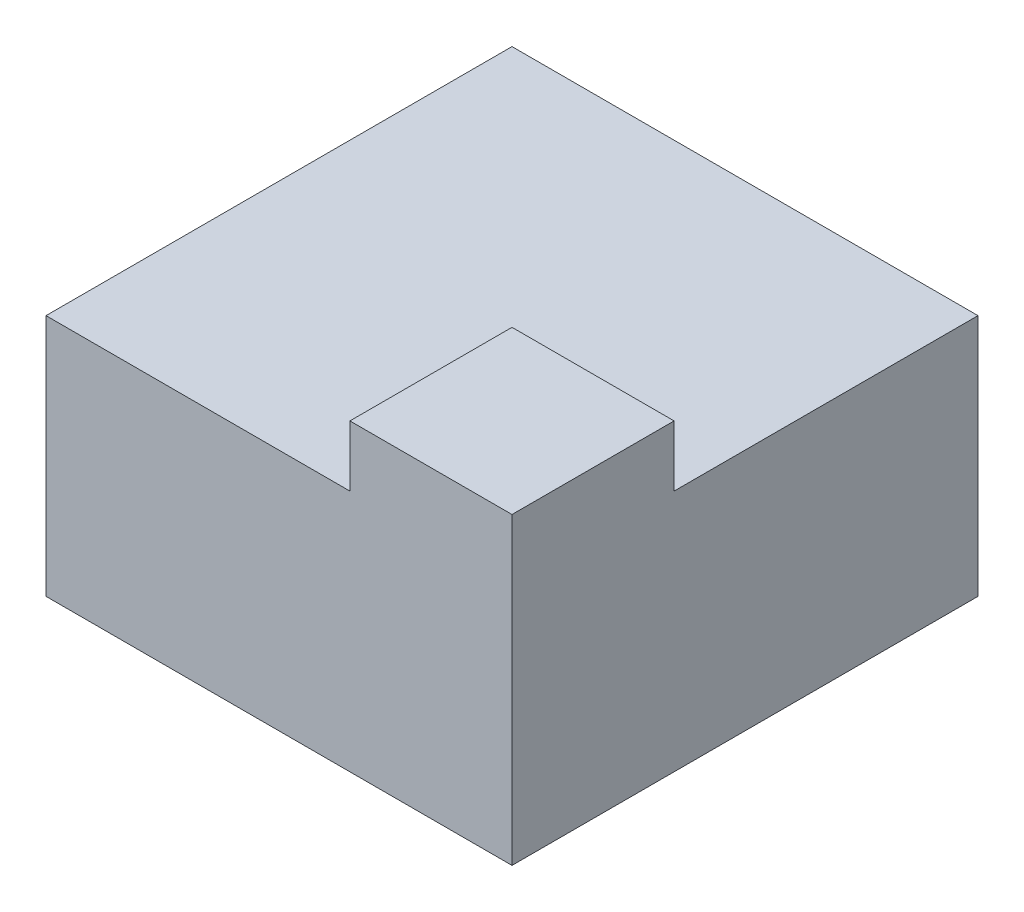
from build123d import *

# Parameters (mm, degrees)
SKETCH1_W           = 230
SKETCH1_H           = 115
BOSS_EXTRUDE1_DEPTH = 37.5
SKETCH2_W           = 75
SKETCH2_H           = 115
CUT_EXTRUDE1_DEPTH  = 15
SKETCH4_W           = 155
SKETCH4_H           = 75
CUT_EXTRUDE3_DEPTH  = 15
CUT_EXTRUDE4_DEPTH  = 115


with BuildPart() as part:
    # Sketch1 → Boss-Extrude1 (new, symmetric)
    with BuildSketch(Plane(origin=(0, 0, 0), x_dir=(1, 0, 0), z_dir=(0, 1, 0))):
        Rectangle(SKETCH1_W, SKETCH1_H)
    extrude(amount=BOSS_EXTRUDE1_DEPTH, both=True)

    # Sketch2 → Cut-Extrude1 (cut)
    with BuildSketch(Plane(origin=(0, 37.5, 0), x_dir=(1, 0, 0), z_dir=(0, 1, 0))):
        with Locations((-77.5, 0)):
            Rectangle(SKETCH2_W, SKETCH2_H)
    extrude(amount=-CUT_EXTRUDE1_DEPTH, mode=Mode.SUBTRACT)

    # Sketch4 → Cut-Extrude3 (cut)
    with BuildSketch(Plane(origin=(0, 37.5, 0), x_dir=(1, 0, 0), z_dir=(0, 1, 0))):
        with Locations((37.5, 20)):
            Rectangle(SKETCH4_W, SKETCH4_H)
    extrude(amount=-CUT_EXTRUDE3_DEPTH, mode=Mode.SUBTRACT)

    # Sketch5 → Cut-Extrude4 (cut)
    with BuildSketch(Plane(origin=(115, 0, 0), x_dir=(0, 0, -1), z_dir=(1, 0, 0))):
        Polygon((-57.5, 37.5), (-17.5, 37.5), (-17.5, 22.5), (57.5, 22.5), (57.5, -37.5), (-57.5, -37.5), align=None)
    extrude(amount=-CUT_EXTRUDE4_DEPTH, mode=Mode.SUBTRACT)


solid = part.part
